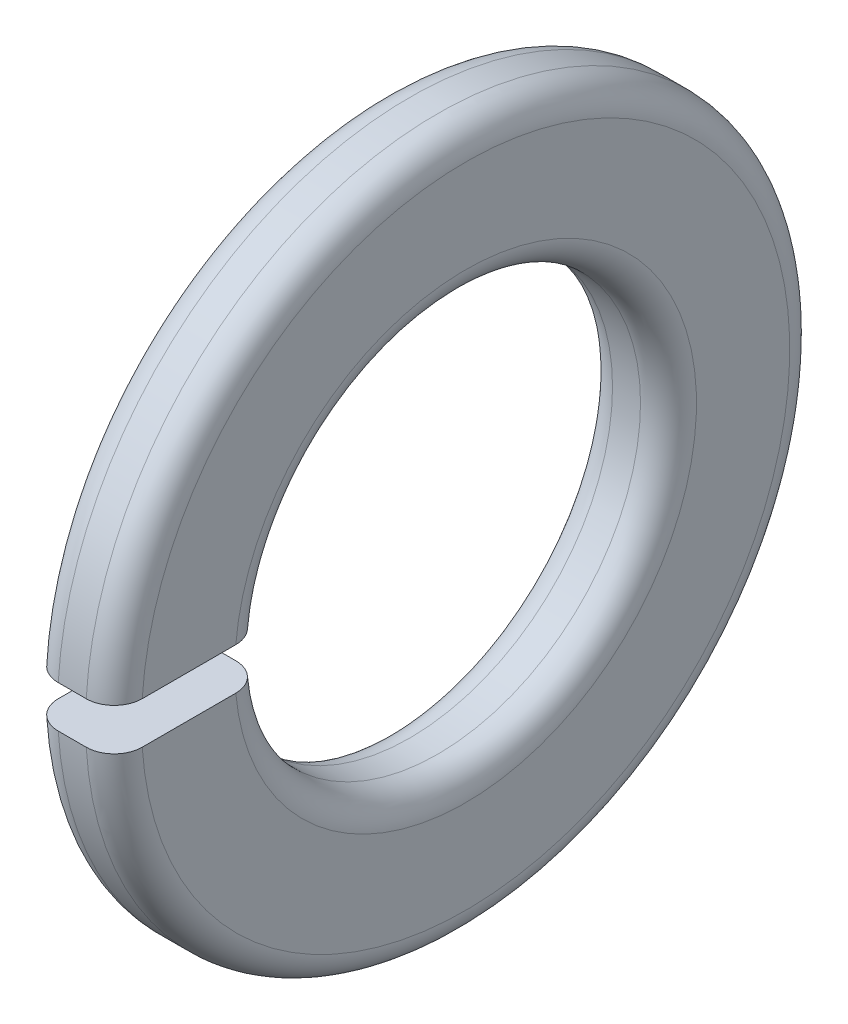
ISO-10303-21;
HEADER;
FILE_DESCRIPTION(('STEP AP214'),'2;1');
FILE_NAME('part.step','',(''),(''),'','','');
FILE_SCHEMA(('AUTOMOTIVE_DESIGN { 1 0 10303 214 1 1 1 1 }'));
ENDSEC;
DATA;
#1=APPLICATION_CONTEXT('core data for automotive mechanical design processes');
#2=APPLICATION_PROTOCOL_DEFINITION('international standard','automotive_design',2000,#1);
#3=PRODUCT_CONTEXT('',#1,'mechanical');
#4=PRODUCT('Part','Part','',(#3));
#5=PRODUCT_RELATED_PRODUCT_CATEGORY('part','',(#4));
#6=PRODUCT_DEFINITION_FORMATION('','',#4);
#7=PRODUCT_DEFINITION_CONTEXT('part definition',#1,'design');
#8=PRODUCT_DEFINITION('design','',#6,#7);
#9=PRODUCT_DEFINITION_SHAPE('','',#8);
#10=(LENGTH_UNIT() NAMED_UNIT(*) SI_UNIT(.MILLI.,.METRE.));
#11=(NAMED_UNIT(*) PLANE_ANGLE_UNIT() SI_UNIT($,.RADIAN.));
#12=(NAMED_UNIT(*) SI_UNIT($,.STERADIAN.) SOLID_ANGLE_UNIT());
#13=UNCERTAINTY_MEASURE_WITH_UNIT(LENGTH_MEASURE(1.E-05),#10,'distance_accuracy_value','');
#14=(GEOMETRIC_REPRESENTATION_CONTEXT(3) GLOBAL_UNCERTAINTY_ASSIGNED_CONTEXT((#13)) GLOBAL_UNIT_ASSIGNED_CONTEXT((#10,
#11,#12)) REPRESENTATION_CONTEXT('',''));
#15=CARTESIAN_POINT('',(0.,0.,0.));
#16=DIRECTION('',(0.,0.,1.));
#17=DIRECTION('',(1.,0.,0.));
#18=AXIS2_PLACEMENT_3D('',#15,#16,#17);
#19=CARTESIAN_POINT('',(-0.599999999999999,0.,0.));
#20=DIRECTION('',(-1.,0.,0.));
#21=DIRECTION('',(0.,0.,1.));
#22=AXIS2_PLACEMENT_3D('',#19,#20,#21);
#23=TOROIDAL_SURFACE('',#22,2.475,0.299999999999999);
#24=CARTESIAN_POINT('',(-0.599999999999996,0.,0.));
#25=DIRECTION('',(-1.,0.,0.));
#26=DIRECTION('',(0.,0.,1.));
#27=AXIS2_PLACEMENT_3D('',#24,#25,#26);
#28=CIRCLE('',#27,2.175);
#29=CARTESIAN_POINT('',(-0.599999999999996,0.225,2.16333076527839));
#30=VERTEX_POINT('',#29);
#31=CARTESIAN_POINT('',(-0.599999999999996,-0.225,2.16333076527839));
#32=VERTEX_POINT('',#31);
#33=EDGE_CURVE('E126',#30,#32,#28,.T.);
#34=ORIENTED_EDGE('',*,*,#33,.F.);
#35=CARTESIAN_POINT('',(-0.65871838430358,0.225,2.16916451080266));
#36=CARTESIAN_POINT('',(-0.675211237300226,0.225,2.17247473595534));
#37=CARTESIAN_POINT('',(-0.691435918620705,0.225,2.17718443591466));
#38=CARTESIAN_POINT('',(-0.722875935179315,0.225,2.18926878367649));
#39=CARTESIAN_POINT('',(-0.738090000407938,0.225,2.1966467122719));
#40=CARTESIAN_POINT('',(-0.767055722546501,0.225,2.21384591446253));
#41=CARTESIAN_POINT('',(-0.780808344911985,0.225,2.22366556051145));
#42=CARTESIAN_POINT('',(-0.806473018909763,0.225,2.24546424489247));
#43=CARTESIAN_POINT('',(-0.818385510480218,0.225,2.25744276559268));
#44=CARTESIAN_POINT('',(-0.840082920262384,0.225,2.28326472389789));
#45=CARTESIAN_POINT('',(-0.849860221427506,0.225,2.29711456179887));
#46=CARTESIAN_POINT('',(-0.866963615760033,0.225,2.32625371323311));
#47=CARTESIAN_POINT('',(-0.874289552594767,0.225,2.34154311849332));
#48=CARTESIAN_POINT('',(-0.886314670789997,0.225,2.37320122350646));
#49=CARTESIAN_POINT('',(-0.891001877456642,0.225,2.3895744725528));
#50=CARTESIAN_POINT('',(-0.897567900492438,0.225,2.42287478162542));
#51=CARTESIAN_POINT('',(-0.899446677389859,0.225,2.43980184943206));
#52=CARTESIAN_POINT('',(-0.900343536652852,0.225,2.47376991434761));
#53=CARTESIAN_POINT('',(-0.899355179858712,0.225,2.49081108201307));
#54=CARTESIAN_POINT('',(-0.894529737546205,0.225,2.52448531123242));
#55=CARTESIAN_POINT('',(-0.890692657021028,0.225,2.54111837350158));
#56=CARTESIAN_POINT('',(-0.880278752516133,0.225,2.57349180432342));
#57=CARTESIAN_POINT('',(-0.873703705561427,0.225,2.5892327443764));
#58=CARTESIAN_POINT('',(-0.85799705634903,0.225,2.61938297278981));
#59=CARTESIAN_POINT('',(-0.848865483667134,0.225,2.63379227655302));
#60=CARTESIAN_POINT('',(-0.828331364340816,0.225,2.66082647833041));
#61=CARTESIAN_POINT('',(-0.81693522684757,0.225,2.67345624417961));
#62=CARTESIAN_POINT('',(-0.792177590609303,0.225,2.69661482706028));
#63=CARTESIAN_POINT('',(-0.778816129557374,0.225,2.70714368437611));
#64=CARTESIAN_POINT('',(-0.750558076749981,0.225,2.72576208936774));
#65=CARTESIAN_POINT('',(-0.735667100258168,0.225,2.73386015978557));
#66=CARTESIAN_POINT('',(-0.704734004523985,0.225,2.7474327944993));
#67=CARTESIAN_POINT('',(-0.688691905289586,0.225,2.75290740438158));
#68=CARTESIAN_POINT('',(-0.655963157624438,0.225,2.761062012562));
#69=CARTESIAN_POINT('',(-0.639278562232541,0.225,2.7637502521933));
#70=CARTESIAN_POINT('',(-0.605694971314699,0.225,2.76628295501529));
#71=CARTESIAN_POINT('',(-0.58879597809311,0.225,2.76612744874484));
#72=CARTESIAN_POINT('',(-0.555289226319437,0.225,2.76297952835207));
#73=CARTESIAN_POINT('',(-0.538681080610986,0.225,2.75999123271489));
#74=CARTESIAN_POINT('',(-0.506201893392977,0.225,2.7512700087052));
#75=CARTESIAN_POINT('',(-0.490330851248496,0.225,2.74553708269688));
#76=CARTESIAN_POINT('',(-0.45976749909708,0.225,2.73148837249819));
#77=CARTESIAN_POINT('',(-0.445075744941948,0.225,2.72317137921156));
#78=CARTESIAN_POINT('',(-0.417292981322,0.225,2.70419414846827));
#79=CARTESIAN_POINT('',(-0.404201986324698,0.225,2.69353388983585));
#80=CARTESIAN_POINT('',(-0.379959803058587,0.225,2.67014807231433));
#81=CARTESIAN_POINT('',(-0.36881305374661,0.225,2.65741791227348));
#82=CARTESIAN_POINT('',(-0.348806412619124,0.225,2.63027228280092));
#83=CARTESIAN_POINT('',(-0.339946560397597,0.225,2.61585678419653));
#84=CARTESIAN_POINT('',(-0.324733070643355,0.225,2.58569775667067));
#85=CARTESIAN_POINT('',(-0.318388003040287,0.225,2.56994990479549));
#86=CARTESIAN_POINT('',(-0.308421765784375,0.225,2.53761469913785));
#87=CARTESIAN_POINT('',(-0.304800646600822,0.225,2.52102732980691));
#88=CARTESIAN_POINT('',(-0.300373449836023,0.225,2.48742411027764));
#89=CARTESIAN_POINT('',(-0.299576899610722,0.225,2.47040700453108));
#90=CARTESIAN_POINT('',(-0.300845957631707,0.225,2.43647972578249));
#91=CARTESIAN_POINT('',(-0.302911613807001,0.225,2.4195695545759));
#92=CARTESIAN_POINT('',(-0.309853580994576,0.225,2.38630164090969));
#93=CARTESIAN_POINT('',(-0.314735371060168,0.225,2.36994504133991));
#94=CARTESIAN_POINT('',(-0.3271773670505,0.225,2.33828415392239));
#95=CARTESIAN_POINT('',(-0.334737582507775,0.225,2.32297986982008));
#96=CARTESIAN_POINT('',(-0.35231952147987,0.225,2.29387051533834));
#97=CARTESIAN_POINT('',(-0.362339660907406,0.225,2.28006448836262));
#98=CARTESIAN_POINT('',(-0.384562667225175,0.225,2.25433854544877));
#99=CARTESIAN_POINT('',(-0.396765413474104,0.225,2.24241852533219));
#100=CARTESIAN_POINT('',(-0.422961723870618,0.225,2.22084962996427));
#101=CARTESIAN_POINT('',(-0.43694868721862,0.225,2.21119273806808));
#102=CARTESIAN_POINT('',(-0.466355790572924,0.225,2.19437549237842));
#103=CARTESIAN_POINT('',(-0.481776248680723,0.225,2.18721569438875));
#104=CARTESIAN_POINT('',(-0.513533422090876,0.225,2.17563318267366));
#105=CARTESIAN_POINT('',(-0.529865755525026,0.225,2.17119843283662));
#106=CARTESIAN_POINT('',(-0.563030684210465,0.225,2.16515166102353));
#107=CARTESIAN_POINT('',(-0.579862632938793,0.225,2.16353614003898));
#108=CARTESIAN_POINT('',(-0.607101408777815,0.225,2.16323341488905));
#109=CARTESIAN_POINT('',(-0.617506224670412,0.225,2.16366327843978));
#110=CARTESIAN_POINT('',(-0.638214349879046,0.225,2.16560515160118));
#111=CARTESIAN_POINT('',(-0.648517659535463,0.225,2.16711715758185));
#112=CARTESIAN_POINT('',(-0.65871838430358,0.225,2.16916451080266));
#113=B_SPLINE_CURVE_WITH_KNOTS('',3,(#35,#36,#37,#38,#39,#40,#41,#42,#43,#44,#45,#46,#47,#48,
#49,#50,#51,#52,#53,#54,#55,#56,#57,#58,#59,#60,#61,#62,#63,#64,#65,#66,#67,#68,#69,#70,#71,#72,
#73,#74,#75,#76,#77,#78,#79,#80,#81,#82,#83,#84,#85,#86,#87,#88,#89,#90,#91,#92,#93,#94,#95,#96,
#97,#98,#99,#100,#101,#102,#103,#104,#105,#106,#107,#108,#109,#110,#111,#112),.UNSPECIFIED.,.T.,
.F.,(4,2,2,2,2,2,2,2,2,2,2,2,2,2,2,2,2,2,2,2,2,2,2,2,2,2,2,2,2,2,2,2,2,2,2,2,2,2,4),(0.,
0.0504271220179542,0.100916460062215,0.151372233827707,0.201815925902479,0.252436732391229,
0.303060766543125,0.353912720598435,0.404765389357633,0.455732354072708,0.506699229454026,
0.557633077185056,0.608566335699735,0.659357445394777,0.710147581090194,0.760757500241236,
0.811366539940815,0.861825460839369,0.912283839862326,0.962668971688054,1.01305406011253,
1.06346275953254,1.11387191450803,1.16439469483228,1.21491834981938,1.26561272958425,
1.31630804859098,1.36717420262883,1.41804120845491,1.46900751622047,1.51997400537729,
1.57090775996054,1.62183870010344,1.67258640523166,1.72334539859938,1.77387855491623,
1.82434894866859,1.85553790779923,1.88672676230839),.UNSPECIFIED.);
#114=CARTESIAN_POINT('',(-0.9,0.225,2.46475150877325));
#115=VERTEX_POINT('',#114);
#116=EDGE_CURVE('E50',#30,#115,#113,.T.);
#117=ORIENTED_EDGE('',*,*,#116,.T.);
#118=CARTESIAN_POINT('',(-0.899999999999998,0.,0.));
#119=DIRECTION('',(-1.,0.,0.));
#120=DIRECTION('',(0.,0.,1.));
#121=AXIS2_PLACEMENT_3D('',#118,#119,#120);
#122=CIRCLE('',#121,2.475);
#123=CARTESIAN_POINT('',(-0.9,-0.225,2.46475150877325));
#124=VERTEX_POINT('',#123);
#125=EDGE_CURVE('E138',#115,#124,#122,.T.);
#126=ORIENTED_EDGE('',*,*,#125,.T.);
#127=CARTESIAN_POINT('',(-0.65871838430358,-0.225,2.16916451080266));
#128=CARTESIAN_POINT('',(-0.642276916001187,-0.225,2.16586614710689));
#129=CARTESIAN_POINT('',(-0.625545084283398,-0.225,2.16395367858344));
#130=CARTESIAN_POINT('',(-0.591984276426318,-0.225,2.16296535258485));
#131=CARTESIAN_POINT('',(-0.57515520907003,-0.225,2.16389283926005));
#132=CARTESIAN_POINT('',(-0.541899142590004,-0.225,2.16856069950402));
#133=CARTESIAN_POINT('',(-0.525471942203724,-0.225,2.17229963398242));
#134=CARTESIAN_POINT('',(-0.493481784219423,-0.225,2.18247834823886));
#135=CARTESIAN_POINT('',(-0.47791862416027,-0.225,2.18891749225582));
#136=CARTESIAN_POINT('',(-0.448070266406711,-0.225,2.20431882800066));
#137=CARTESIAN_POINT('',(-0.433786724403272,-0.225,2.2132842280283));
#138=CARTESIAN_POINT('',(-0.406918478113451,-0.225,2.23347629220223));
#139=CARTESIAN_POINT('',(-0.394333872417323,-0.225,2.24470308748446));
#140=CARTESIAN_POINT('',(-0.371162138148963,-0.225,2.26915061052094));
#141=CARTESIAN_POINT('',(-0.360583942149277,-0.225,2.28237980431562));
#142=CARTESIAN_POINT('',(-0.341786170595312,-0.225,2.31041933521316));
#143=CARTESIAN_POINT('',(-0.333566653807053,-0.225,2.32522971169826));
#144=CARTESIAN_POINT('',(-0.319679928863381,-0.225,2.35608684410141));
#145=CARTESIAN_POINT('',(-0.314024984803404,-0.225,2.37213911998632));
#146=CARTESIAN_POINT('',(-0.305481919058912,-0.225,2.40496381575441));
#147=CARTESIAN_POINT('',(-0.302593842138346,-0.225,2.42173624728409));
#148=CARTESIAN_POINT('',(-0.299661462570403,-0.225,2.45557450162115));
#149=CARTESIAN_POINT('',(-0.299624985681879,-0.225,2.4726410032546));
#150=CARTESIAN_POINT('',(-0.302418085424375,-0.225,2.50653800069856));
#151=CARTESIAN_POINT('',(-0.30524767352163,-0.225,2.52336849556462));
#152=CARTESIAN_POINT('',(-0.313694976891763,-0.225,2.55631201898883));
#153=CARTESIAN_POINT('',(-0.319312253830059,-0.225,2.57242515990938));
#154=CARTESIAN_POINT('',(-0.333178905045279,-0.225,2.60347615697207));
#155=CARTESIAN_POINT('',(-0.341428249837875,-0.225,2.61841402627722));
#156=CARTESIAN_POINT('',(-0.360303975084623,-0.225,2.64664964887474));
#157=CARTESIAN_POINT('',(-0.370924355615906,-0.225,2.65995141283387));
#158=CARTESIAN_POINT('',(-0.394254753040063,-0.225,2.68457520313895));
#159=CARTESIAN_POINT('',(-0.40696473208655,-0.225,2.69589726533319));
#160=CARTESIAN_POINT('',(-0.43406557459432,-0.225,2.71619786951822));
#161=CARTESIAN_POINT('',(-0.448450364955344,-0.225,2.72518451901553));
#162=CARTESIAN_POINT('',(-0.478528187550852,-0.225,2.74060635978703));
#163=CARTESIAN_POINT('',(-0.494221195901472,-0.225,2.74704159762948));
#164=CARTESIAN_POINT('',(-0.526416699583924,-0.225,2.7571577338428));
#165=CARTESIAN_POINT('',(-0.542916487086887,-0.225,2.76084725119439));
#166=CARTESIAN_POINT('',(-0.57630151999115,-0.225,2.76539838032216));
#167=CARTESIAN_POINT('',(-0.593186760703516,-0.225,2.76626002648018));
#168=CARTESIAN_POINT('',(-0.626831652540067,-0.225,2.7651315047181));
#169=CARTESIAN_POINT('',(-0.643591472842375,-0.225,2.76314637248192));
#170=CARTESIAN_POINT('',(-0.676539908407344,-0.225,2.75639078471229));
#171=CARTESIAN_POINT('',(-0.692728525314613,-0.225,2.751620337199));
#172=CARTESIAN_POINT('',(-0.724077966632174,-0.225,2.73943093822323));
#173=CARTESIAN_POINT('',(-0.73923866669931,-0.225,2.73201166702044));
#174=CARTESIAN_POINT('',(-0.768102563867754,-0.225,2.71473793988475));
#175=CARTESIAN_POINT('',(-0.781805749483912,-0.225,2.70488346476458));
#176=CARTESIAN_POINT('',(-0.807395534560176,-0.225,2.68299951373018));
#177=CARTESIAN_POINT('',(-0.819278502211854,-0.225,2.67096579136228));
#178=CARTESIAN_POINT('',(-0.840863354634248,-0.225,2.64507984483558));
#179=CARTESIAN_POINT('',(-0.850565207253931,-0.225,2.63122759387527));
#180=CARTESIAN_POINT('',(-0.867546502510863,-0.225,2.60204995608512));
#181=CARTESIAN_POINT('',(-0.874817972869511,-0.225,2.58671992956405));
#182=CARTESIAN_POINT('',(-0.886694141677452,-0.225,2.55505955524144));
#183=CARTESIAN_POINT('',(-0.891298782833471,-0.225,2.5387291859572));
#184=CARTESIAN_POINT('',(-0.897726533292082,-0.225,2.50547104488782));
#185=CARTESIAN_POINT('',(-0.899539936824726,-0.225,2.48854139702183));
#186=CARTESIAN_POINT('',(-0.900305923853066,-0.225,2.45461740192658));
#187=CARTESIAN_POINT('',(-0.899258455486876,-0.225,2.43762305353));
#188=CARTESIAN_POINT('',(-0.894327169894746,-0.225,2.40401036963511));
#189=CARTESIAN_POINT('',(-0.890436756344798,-0.225,2.38739300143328));
#190=CARTESIAN_POINT('',(-0.879921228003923,-0.225,2.35504780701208));
#191=CARTESIAN_POINT('',(-0.873296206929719,-0.225,2.33931995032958));
#192=CARTESIAN_POINT('',(-0.85749849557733,-0.225,2.309205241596));
#193=CARTESIAN_POINT('',(-0.848326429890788,-0.225,2.294818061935));
#194=CARTESIAN_POINT('',(-0.827687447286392,-0.225,2.26778997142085));
#195=CARTESIAN_POINT('',(-0.816219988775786,-0.225,2.25514947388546));
#196=CARTESIAN_POINT('',(-0.791348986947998,-0.225,2.23201600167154));
#197=CARTESIAN_POINT('',(-0.77795047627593,-0.225,2.22151761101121));
#198=CARTESIAN_POINT('',(-0.749583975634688,-0.225,2.20294330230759));
#199=CARTESIAN_POINT('',(-0.734617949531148,-0.225,2.19486440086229));
#200=CARTESIAN_POINT('',(-0.709396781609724,-0.225,2.18389737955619));
#201=CARTESIAN_POINT('',(-0.69948543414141,-0.225,2.18019958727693));
#202=CARTESIAN_POINT('',(-0.67932729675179,-0.225,2.17387253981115));
#203=CARTESIAN_POINT('',(-0.669080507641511,-0.225,2.17124328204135));
#204=CARTESIAN_POINT('',(-0.65871838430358,-0.225,2.16916451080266));
#205=B_SPLINE_CURVE_WITH_KNOTS('',3,(#127,#128,#129,#130,#131,#132,#133,#134,#135,#136,#137,
#138,#139,#140,#141,#142,#143,#144,#145,#146,#147,#148,#149,#150,#151,#152,#153,#154,#155,#156,
#157,#158,#159,#160,#161,#162,#163,#164,#165,#166,#167,#168,#169,#170,#171,#172,#173,#174,#175,
#176,#177,#178,#179,#180,#181,#182,#183,#184,#185,#186,#187,#188,#189,#190,#191,#192,#193,#194,
#195,#196,#197,#198,#199,#200,#201,#202,#203,#204),.UNSPECIFIED.,.T.,.F.,(4,2,2,2,2,2,2,2,2,2,2,
2,2,2,2,2,2,2,2,2,2,2,2,2,2,2,2,2,2,2,2,2,2,2,2,2,2,2,4),(0.,0.0502685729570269,
0.100596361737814,0.150898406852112,0.201188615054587,0.251542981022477,0.301900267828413,
0.352476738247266,0.403054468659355,0.453871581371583,0.504689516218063,0.555646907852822,
0.606604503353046,0.657554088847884,0.708503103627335,0.75932462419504,0.810145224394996,
0.860786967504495,0.911427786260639,0.961908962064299,1.01238952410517,1.06278090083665,
1.11317213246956,1.16356944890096,1.21396716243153,1.26446415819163,1.314961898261,
1.36562369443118,1.41628657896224,1.46712523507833,1.5179648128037,1.56892272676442,
1.61987889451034,1.67082257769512,1.72177829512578,1.7726035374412,1.82336584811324,
1.85504735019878,1.88672877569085),.UNSPECIFIED.);
#206=EDGE_CURVE('E117',#124,#32,#205,.T.);
#207=ORIENTED_EDGE('',*,*,#206,.T.);
#208=EDGE_LOOP('',(#34,#117,#126,#207));
#209=FACE_BOUND('',#208,.T.);
#210=ADVANCED_FACE('F36',(#209),#23,.T.);
#211=CARTESIAN_POINT('',(-0.9,3.475,0.));
#212=DIRECTION('',(1.,0.,0.));
#213=DIRECTION('',(0.,0.,-1.));
#214=AXIS2_PLACEMENT_3D('',#211,#212,#213);
#215=PLANE('',#214);
#216=DIRECTION('',(0.,0.,-1.));
#217=VECTOR('',#216,1.);
#218=CARTESIAN_POINT('',(-0.9,0.225,3.8505));
#219=LINE('',#218,#217);
#220=CARTESIAN_POINT('',(-0.9,0.225,3.46770817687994));
#221=VERTEX_POINT('',#220);
#222=EDGE_CURVE('E106',#221,#115,#219,.T.);
#223=ORIENTED_EDGE('',*,*,#222,.F.);
#224=CARTESIAN_POINT('',(-0.899999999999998,0.,0.));
#225=DIRECTION('',(-1.,0.,0.));
#226=DIRECTION('',(0.,0.,1.));
#227=AXIS2_PLACEMENT_3D('',#224,#225,#226);
#228=CIRCLE('',#227,3.475);
#229=CARTESIAN_POINT('',(-0.9,-0.225,3.46770817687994));
#230=VERTEX_POINT('',#229);
#231=EDGE_CURVE('E135',#221,#230,#228,.T.);
#232=ORIENTED_EDGE('',*,*,#231,.T.);
#233=DIRECTION('',(0.,0.,1.));
#234=VECTOR('',#233,1.);
#235=CARTESIAN_POINT('',(-0.9,-0.225,0.));
#236=LINE('',#235,#234);
#237=EDGE_CURVE('E118',#124,#230,#236,.T.);
#238=ORIENTED_EDGE('',*,*,#237,.F.);
#239=ORIENTED_EDGE('',*,*,#125,.F.);
#240=EDGE_LOOP('',(#223,#232,#238,#239));
#241=FACE_BOUND('',#240,.T.);
#242=ADVANCED_FACE('F211',(#241),#215,.F.);
#243=CARTESIAN_POINT('',(-0.6,0.,0.));
#244=DIRECTION('',(-1.,0.,0.));
#245=DIRECTION('',(0.,0.,1.));
#246=AXIS2_PLACEMENT_3D('',#243,#244,#245);
#247=TOROIDAL_SURFACE('',#246,3.475,0.3);
#248=CARTESIAN_POINT('',(-0.740885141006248,0.225,3.20224406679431));
#249=CARTESIAN_POINT('',(-0.726044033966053,0.225,3.19433115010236));
#250=CARTESIAN_POINT('',(-0.710524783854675,0.225,3.18766439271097));
#251=CARTESIAN_POINT('',(-0.678574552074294,0.225,3.17702533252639));
#252=CARTESIAN_POINT('',(-0.662142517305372,0.225,3.17305621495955));
#253=CARTESIAN_POINT('',(-0.628850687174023,0.225,3.16793624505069));
#254=CARTESIAN_POINT('',(-0.611991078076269,0.225,3.16678418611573));
#255=CARTESIAN_POINT('',(-0.578322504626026,0.225,3.16732925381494));
#256=CARTESIAN_POINT('',(-0.561513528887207,0.225,3.16902568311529));
#257=CARTESIAN_POINT('',(-0.528426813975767,0.225,3.17521562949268));
#258=CARTESIAN_POINT('',(-0.512148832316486,0.225,3.1797078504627));
#259=CARTESIAN_POINT('',(-0.480576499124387,0.225,3.19135918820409));
#260=CARTESIAN_POINT('',(-0.465282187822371,0.225,3.19851841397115));
#261=CARTESIAN_POINT('',(-0.436096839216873,0.225,3.21530576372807));
#262=CARTESIAN_POINT('',(-0.422207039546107,0.225,3.22493603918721));
#263=CARTESIAN_POINT('',(-0.396236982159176,0.225,3.24638716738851));
#264=CARTESIAN_POINT('',(-0.384156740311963,0.225,3.25820803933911));
#265=CARTESIAN_POINT('',(-0.362120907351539,0.225,3.28373154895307));
#266=CARTESIAN_POINT('',(-0.352169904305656,0.225,3.29743814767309));
#267=CARTESIAN_POINT('',(-0.334704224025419,0.225,3.32632438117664));
#268=CARTESIAN_POINT('',(-0.327189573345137,0.225,3.34150403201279));
#269=CARTESIAN_POINT('',(-0.31479292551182,0.225,3.37294200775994));
#270=CARTESIAN_POINT('',(-0.309916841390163,0.225,3.3892026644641));
#271=CARTESIAN_POINT('',(-0.302959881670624,0.225,3.42231137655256));
#272=CARTESIAN_POINT('',(-0.30087903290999,0.225,3.43915943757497));
#273=CARTESIAN_POINT('',(-0.299570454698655,0.225,3.47298759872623));
#274=CARTESIAN_POINT('',(-0.300346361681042,0.225,3.48996783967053));
#275=CARTESIAN_POINT('',(-0.304738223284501,0.225,3.52355704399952));
#276=CARTESIAN_POINT('',(-0.3083541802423,0.225,3.54016600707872));
#277=CARTESIAN_POINT('',(-0.31832437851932,0.225,3.57253831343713));
#278=CARTESIAN_POINT('',(-0.324678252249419,0.225,3.58830176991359));
#279=CARTESIAN_POINT('',(-0.339945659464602,0.225,3.61853622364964));
#280=CARTESIAN_POINT('',(-0.348859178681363,0.225,3.63300722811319));
#281=CARTESIAN_POINT('',(-0.368980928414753,0.225,3.66022522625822));
#282=CARTESIAN_POINT('',(-0.380186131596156,0.225,3.67297445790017));
#283=CARTESIAN_POINT('',(-0.404581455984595,0.225,3.69640647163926));
#284=CARTESIAN_POINT('',(-0.417771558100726,0.225,3.70708927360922));
#285=CARTESIAN_POINT('',(-0.445736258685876,0.225,3.72606430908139));
#286=CARTESIAN_POINT('',(-0.460507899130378,0.225,3.73436090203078));
#287=CARTESIAN_POINT('',(-0.49123607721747,0.225,3.74835170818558));
#288=CARTESIAN_POINT('',(-0.507192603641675,0.225,3.75404594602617));
#289=CARTESIAN_POINT('',(-0.539809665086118,0.225,3.76266133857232));
#290=CARTESIAN_POINT('',(-0.556469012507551,0.225,3.76558698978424));
#291=CARTESIAN_POINT('',(-0.590042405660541,0.225,3.76859728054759));
#292=CARTESIAN_POINT('',(-0.606956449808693,0.225,3.76868193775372));
#293=CARTESIAN_POINT('',(-0.640544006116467,0.225,3.76600898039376));
#294=CARTESIAN_POINT('',(-0.657217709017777,0.225,3.76325376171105));
#295=CARTESIAN_POINT('',(-0.689866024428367,0.225,3.75498370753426));
#296=CARTESIAN_POINT('',(-0.705840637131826,0.225,3.74946887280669));
#297=CARTESIAN_POINT('',(-0.736641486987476,0.225,3.73583593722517));
#298=CARTESIAN_POINT('',(-0.751467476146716,0.225,3.72771727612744));
#299=CARTESIAN_POINT('',(-0.779548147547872,0.225,3.70910895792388));
#300=CARTESIAN_POINT('',(-0.792802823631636,0.225,3.69861929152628));
#301=CARTESIAN_POINT('',(-0.817382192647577,0.225,3.67555380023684));
#302=CARTESIAN_POINT('',(-0.828704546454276,0.225,3.66297548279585));
#303=CARTESIAN_POINT('',(-0.84908136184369,0.225,3.63609941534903));
#304=CARTESIAN_POINT('',(-0.858135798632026,0.225,3.62180164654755));
#305=CARTESIAN_POINT('',(-0.873737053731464,0.225,3.59186528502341));
#306=CARTESIAN_POINT('',(-0.880279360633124,0.225,3.5762243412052));
#307=CARTESIAN_POINT('',(-0.890650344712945,0.225,3.54406725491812));
#308=CARTESIAN_POINT('',(-0.894478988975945,0.225,3.52755110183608));
#309=CARTESIAN_POINT('',(-0.899320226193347,0.225,3.49408169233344));
#310=CARTESIAN_POINT('',(-0.90032790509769,0.225,3.47712772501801));
#311=CARTESIAN_POINT('',(-0.899485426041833,0.225,3.44329153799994));
#312=CARTESIAN_POINT('',(-0.897635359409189,0.225,3.42640931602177));
#313=CARTESIAN_POINT('',(-0.891127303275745,0.225,3.39318078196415));
#314=CARTESIAN_POINT('',(-0.886467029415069,0.225,3.37683491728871));
#315=CARTESIAN_POINT('',(-0.874465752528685,0.225,3.34515365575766));
#316=CARTESIAN_POINT('',(-0.867124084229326,0.225,3.32981851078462));
#317=CARTESIAN_POINT('',(-0.849968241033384,0.225,3.30060051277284));
#318=CARTESIAN_POINT('',(-0.840153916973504,0.225,3.28671774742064));
#319=CARTESIAN_POINT('',(-0.818336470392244,0.225,3.26081393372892));
#320=CARTESIAN_POINT('',(-0.806336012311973,0.225,3.24879065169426));
#321=CARTESIAN_POINT('',(-0.78532389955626,0.225,3.23102383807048));
#322=CARTESIAN_POINT('',(-0.776868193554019,0.225,3.22461127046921));
#323=CARTESIAN_POINT('',(-0.759326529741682,0.225,3.2127154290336));
#324=CARTESIAN_POINT('',(-0.750240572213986,0.225,3.20723215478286));
#325=CARTESIAN_POINT('',(-0.740885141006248,0.225,3.20224406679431));
#326=B_SPLINE_CURVE_WITH_KNOTS('',3,(#248,#249,#250,#251,#252,#253,#254,#255,#256,#257,#258,
#259,#260,#261,#262,#263,#264,#265,#266,#267,#268,#269,#270,#271,#272,#273,#274,#275,#276,#277,
#278,#279,#280,#281,#282,#283,#284,#285,#286,#287,#288,#289,#290,#291,#292,#293,#294,#295,#296,
#297,#298,#299,#300,#301,#302,#303,#304,#305,#306,#307,#308,#309,#310,#311,#312,#313,#314,#315,
#316,#317,#318,#319,#320,#321,#322,#323,#324,#325),.UNSPECIFIED.,.T.,.F.,(4,2,2,2,2,2,2,2,2,2,2,
2,2,2,2,2,2,2,2,2,2,2,2,2,2,2,2,2,2,2,2,2,2,2,2,2,2,2,4),(0.,0.0504178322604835,
0.100895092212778,0.151350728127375,0.201794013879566,0.252213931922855,0.302635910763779,
0.353101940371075,0.403568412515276,0.454142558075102,0.504717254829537,0.555404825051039,
0.606092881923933,0.656845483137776,0.707598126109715,0.758343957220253,0.80908950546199,
0.859768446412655,0.910446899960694,0.961032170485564,1.01161696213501,1.06211945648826,
1.11262163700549,1.16308124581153,1.21354084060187,1.26401129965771,1.31448195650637,
1.36501328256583,1.41554516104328,1.4661673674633,1.51679018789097,1.56750113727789,
1.61821046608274,1.66896107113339,1.71972427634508,1.77049054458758,1.82119534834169,
1.85297739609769,1.88475942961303),.UNSPECIFIED.);
#327=CARTESIAN_POINT('',(-0.599999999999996,0.225,3.76828873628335));
#328=VERTEX_POINT('',#327);
#329=EDGE_CURVE('E149',#328,#221,#326,.T.);
#330=ORIENTED_EDGE('',*,*,#329,.F.);
#331=CARTESIAN_POINT('',(-0.599999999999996,0.,0.));
#332=DIRECTION('',(-1.,0.,0.));
#333=DIRECTION('',(0.,0.,1.));
#334=AXIS2_PLACEMENT_3D('',#331,#332,#333);
#335=CIRCLE('',#334,3.775);
#336=CARTESIAN_POINT('',(-0.599999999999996,-0.225,3.76828873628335));
#337=VERTEX_POINT('',#336);
#338=EDGE_CURVE('E132',#328,#337,#335,.T.);
#339=ORIENTED_EDGE('',*,*,#338,.T.);
#340=CARTESIAN_POINT('',(-0.740885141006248,-0.225,3.20224406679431));
#341=CARTESIAN_POINT('',(-0.755769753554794,-0.225,3.21018188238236));
#342=CARTESIAN_POINT('',(-0.769993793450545,-0.225,3.21938485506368));
#343=CARTESIAN_POINT('',(-0.79670537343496,-0.225,3.24005758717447));
#344=CARTESIAN_POINT('',(-0.809190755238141,-0.225,3.25153012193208));
#345=CARTESIAN_POINT('',(-0.832052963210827,-0.225,3.27640206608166));
#346=CARTESIAN_POINT('',(-0.842431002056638,-0.225,3.28980035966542));
#347=CARTESIAN_POINT('',(-0.860791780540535,-0.225,3.3181429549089));
#348=CARTESIAN_POINT('',(-0.868775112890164,-0.225,3.33308687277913));
#349=CARTESIAN_POINT('',(-0.882138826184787,-0.225,3.36412761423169));
#350=CARTESIAN_POINT('',(-0.887514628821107,-0.225,3.38022640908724));
#351=CARTESIAN_POINT('',(-0.895491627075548,-0.225,3.4130980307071));
#352=CARTESIAN_POINT('',(-0.898092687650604,-0.225,3.42987089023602));
#353=CARTESIAN_POINT('',(-0.900448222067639,-0.225,3.46363857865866));
#354=CARTESIAN_POINT('',(-0.900198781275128,-0.225,3.4806336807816));
#355=CARTESIAN_POINT('',(-0.896850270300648,-0.225,3.51434083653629));
#356=CARTESIAN_POINT('',(-0.893751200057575,-0.225,3.53105289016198));
#357=CARTESIAN_POINT('',(-0.884789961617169,-0.225,3.56371905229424));
#358=CARTESIAN_POINT('',(-0.878927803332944,-0.225,3.57967316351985));
#359=CARTESIAN_POINT('',(-0.864605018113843,-0.225,3.61036897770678));
#360=CARTESIAN_POINT('',(-0.856144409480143,-0.225,3.62511068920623));
#361=CARTESIAN_POINT('',(-0.836875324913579,-0.225,3.65294343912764));
#362=CARTESIAN_POINT('',(-0.826069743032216,-0.225,3.666036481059));
#363=CARTESIAN_POINT('',(-0.802410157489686,-0.225,3.69021849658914));
#364=CARTESIAN_POINT('',(-0.789556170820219,-0.225,3.70130748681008));
#365=CARTESIAN_POINT('',(-0.762189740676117,-0.225,3.72114505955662));
#366=CARTESIAN_POINT('',(-0.747680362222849,-0.225,3.72989787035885));
#367=CARTESIAN_POINT('',(-0.717396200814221,-0.225,3.74483858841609));
#368=CARTESIAN_POINT('',(-0.701621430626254,-0.225,3.75102652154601));
#369=CARTESIAN_POINT('',(-0.669282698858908,-0.225,3.76065154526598));
#370=CARTESIAN_POINT('',(-0.652720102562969,-0.225,3.76409322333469));
#371=CARTESIAN_POINT('',(-0.619252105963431,-0.225,3.76814422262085));
#372=CARTESIAN_POINT('',(-0.602346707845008,-0.225,3.76875356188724));
#373=CARTESIAN_POINT('',(-0.56868972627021,-0.225,3.7671231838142));
#374=CARTESIAN_POINT('',(-0.551938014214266,-0.225,3.76488611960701));
#375=CARTESIAN_POINT('',(-0.519047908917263,-0.225,3.75763164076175));
#376=CARTESIAN_POINT('',(-0.502909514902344,-0.225,3.75261422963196));
#377=CARTESIAN_POINT('',(-0.471701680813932,-0.225,3.73994197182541));
#378=CARTESIAN_POINT('',(-0.456632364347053,-0.225,3.73228682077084));
#379=CARTESIAN_POINT('',(-0.427990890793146,-0.225,3.71455795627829));
#380=CARTESIAN_POINT('',(-0.414418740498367,-0.225,3.70448423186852));
#381=CARTESIAN_POINT('',(-0.389140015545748,-0.225,3.68219268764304));
#382=CARTESIAN_POINT('',(-0.377435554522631,-0.225,3.66997247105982));
#383=CARTESIAN_POINT('',(-0.356240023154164,-0.225,3.64374348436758));
#384=CARTESIAN_POINT('',(-0.346748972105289,-0.225,3.62973469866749));
#385=CARTESIAN_POINT('',(-0.330231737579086,-0.225,3.60029996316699));
#386=CARTESIAN_POINT('',(-0.323209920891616,-0.225,3.58487156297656));
#387=CARTESIAN_POINT('',(-0.311850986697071,-0.225,3.55305625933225));
#388=CARTESIAN_POINT('',(-0.307513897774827,-0.225,3.53666934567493));
#389=CARTESIAN_POINT('',(-0.301640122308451,-0.225,3.50337128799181));
#390=CARTESIAN_POINT('',(-0.300108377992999,-0.225,3.48645927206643));
#391=CARTESIAN_POINT('',(-0.299902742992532,-0.225,3.45261784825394));
#392=CARTESIAN_POINT('',(-0.301228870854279,-0.225,3.43568844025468));
#393=CARTESIAN_POINT('',(-0.306704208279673,-0.225,3.40227463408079));
#394=CARTESIAN_POINT('',(-0.310856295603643,-0.225,3.38579070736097));
#395=CARTESIAN_POINT('',(-0.321869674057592,-0.225,3.3537540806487));
#396=CARTESIAN_POINT('',(-0.32873097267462,-0.225,3.33820138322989));
#397=CARTESIAN_POINT('',(-0.344967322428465,-0.225,3.30847434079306));
#398=CARTESIAN_POINT('',(-0.354341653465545,-0.225,3.29429960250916));
#399=CARTESIAN_POINT('',(-0.375340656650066,-0.225,3.26772838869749));
#400=CARTESIAN_POINT('',(-0.386965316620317,-0.225,3.2553319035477));
#401=CARTESIAN_POINT('',(-0.412115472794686,-0.225,3.23269141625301));
#402=CARTESIAN_POINT('',(-0.42563785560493,-0.225,3.22244395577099));
#403=CARTESIAN_POINT('',(-0.454213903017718,-0.225,3.20437139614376));
#404=CARTESIAN_POINT('',(-0.469267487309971,-0.225,3.19654617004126));
#405=CARTESIAN_POINT('',(-0.500439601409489,-0.225,3.18355949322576));
#406=CARTESIAN_POINT('',(-0.516555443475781,-0.225,3.17839159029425));
#407=CARTESIAN_POINT('',(-0.549431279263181,-0.225,3.17083933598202));
#408=CARTESIAN_POINT('',(-0.56619142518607,-0.225,3.16845564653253));
#409=CARTESIAN_POINT('',(-0.599848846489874,-0.225,3.16654364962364));
#410=CARTESIAN_POINT('',(-0.61674590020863,-0.225,3.16701139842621));
#411=CARTESIAN_POINT('',(-0.650206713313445,-0.225,3.17078033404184));
#412=CARTESIAN_POINT('',(-0.666770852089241,-0.225,3.17407808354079));
#413=CARTESIAN_POINT('',(-0.692966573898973,-0.225,3.18163061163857));
#414=CARTESIAN_POINT('',(-0.702847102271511,-0.225,3.18504947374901));
#415=CARTESIAN_POINT('',(-0.722197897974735,-0.225,3.19289854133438));
#416=CARTESIAN_POINT('',(-0.731668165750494,-0.225,3.19732874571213));
#417=CARTESIAN_POINT('',(-0.740885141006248,-0.225,3.20224406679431));
#418=B_SPLINE_CURVE_WITH_KNOTS('',3,(#340,#341,#342,#343,#344,#345,#346,#347,#348,#349,#350,
#351,#352,#353,#354,#355,#356,#357,#358,#359,#360,#361,#362,#363,#364,#365,#366,#367,#368,#369,
#370,#371,#372,#373,#374,#375,#376,#377,#378,#379,#380,#381,#382,#383,#384,#385,#386,#387,#388,
#389,#390,#391,#392,#393,#394,#395,#396,#397,#398,#399,#400,#401,#402,#403,#404,#405,#406,#407,
#408,#409,#410,#411,#412,#413,#414,#415,#416,#417),.UNSPECIFIED.,.T.,.F.,(4,2,2,2,2,2,2,2,2,2,2,
2,2,2,2,2,2,2,2,2,2,2,2,2,2,2,2,2,2,2,2,2,2,2,2,2,2,2,4),(0.,0.0505685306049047,
0.101199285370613,0.151800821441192,0.202389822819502,0.253067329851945,0.30374730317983,
0.354496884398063,0.405246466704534,0.455995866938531,0.506744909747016,0.557431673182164,
0.608118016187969,0.65871198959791,0.709305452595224,0.759814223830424,0.810322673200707,
0.860784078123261,0.911245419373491,0.961712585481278,1.01217998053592,1.06270408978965,
1.11322863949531,1.16384209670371,1.21445609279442,1.26515917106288,1.31586257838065,
1.3666176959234,1.41737295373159,1.46811368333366,1.51885413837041,1.56951230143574,
1.62016780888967,1.67069973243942,1.7212436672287,1.77171771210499,1.82213053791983,
1.853444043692,1.88475751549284),.UNSPECIFIED.);
#419=EDGE_CURVE('E203',#230,#337,#418,.T.);
#420=ORIENTED_EDGE('',*,*,#419,.F.);
#421=ORIENTED_EDGE('',*,*,#231,.F.);
#422=EDGE_LOOP('',(#330,#339,#420,#421));
#423=FACE_BOUND('',#422,.T.);
#424=ADVANCED_FACE('F159',(#423),#247,.T.);
#425=CARTESIAN_POINT('',(-34.9249999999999,0.,0.));
#426=DIRECTION('',(-1.,0.,0.));
#427=DIRECTION('',(0.,0.,1.));
#428=AXIS2_PLACEMENT_3D('',#425,#426,#427);
#429=CYLINDRICAL_SURFACE('',#428,3.775);
#430=DIRECTION('',(-1.,0.,0.));
#431=VECTOR('',#430,1.);
#432=CARTESIAN_POINT('',(-34.9249999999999,0.225,3.76828873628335));
#433=LINE('',#432,#431);
#434=CARTESIAN_POINT('',(-0.300000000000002,0.225,3.76828873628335));
#435=VERTEX_POINT('',#434);
#436=EDGE_CURVE('E150',#435,#328,#433,.T.);
#437=ORIENTED_EDGE('',*,*,#436,.F.);
#438=CARTESIAN_POINT('',(-0.300000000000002,0.,0.));
#439=DIRECTION('',(-1.,0.,0.));
#440=DIRECTION('',(0.,0.,1.));
#441=AXIS2_PLACEMENT_3D('',#438,#439,#440);
#442=CIRCLE('',#441,3.775);
#443=CARTESIAN_POINT('',(-0.299999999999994,-0.225,3.76828873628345));
#444=VERTEX_POINT('',#443);
#445=EDGE_CURVE('E124',#435,#444,#442,.T.);
#446=ORIENTED_EDGE('',*,*,#445,.T.);
#447=DIRECTION('',(-1.,0.,0.));
#448=VECTOR('',#447,1.);
#449=CARTESIAN_POINT('',(-34.9249999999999,-0.225,3.76828873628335));
#450=LINE('',#449,#448);
#451=EDGE_CURVE('E199',#337,#444,#450,.F.);
#452=ORIENTED_EDGE('',*,*,#451,.F.);
#453=ORIENTED_EDGE('',*,*,#338,.F.);
#454=EDGE_LOOP('',(#437,#446,#452,#453));
#455=FACE_BOUND('',#454,.T.);
#456=ADVANCED_FACE('F191',(#455),#429,.T.);
#457=CARTESIAN_POINT('',(-0.3,0.,0.));
#458=DIRECTION('',(-1.,0.,0.));
#459=DIRECTION('',(0.,0.,1.));
#460=AXIS2_PLACEMENT_3D('',#457,#458,#459);
#461=TOROIDAL_SURFACE('',#460,3.475,0.300000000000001);
#462=CARTESIAN_POINT('',(-0.159114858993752,0.225,3.20224406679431));
#463=CARTESIAN_POINT('',(-0.144230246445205,0.225,3.21018188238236));
#464=CARTESIAN_POINT('',(-0.130006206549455,0.225,3.21938485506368));
#465=CARTESIAN_POINT('',(-0.10329462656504,0.225,3.24005758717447));
#466=CARTESIAN_POINT('',(-0.0908092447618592,0.225,3.25153012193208));
#467=CARTESIAN_POINT('',(-0.0679470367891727,0.225,3.27640206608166));
#468=CARTESIAN_POINT('',(-0.0575689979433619,0.225,3.28980035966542));
#469=CARTESIAN_POINT('',(-0.0392082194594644,0.225,3.3181429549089));
#470=CARTESIAN_POINT('',(-0.0312248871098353,0.225,3.33308687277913));
#471=CARTESIAN_POINT('',(-0.0178611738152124,0.225,3.36412761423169));
#472=CARTESIAN_POINT('',(-0.0124853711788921,0.225,3.38022640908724));
#473=CARTESIAN_POINT('',(-0.00450837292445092,0.225,3.4130980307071));
#474=CARTESIAN_POINT('',(-0.00190731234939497,0.225,3.42987089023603));
#475=CARTESIAN_POINT('',(0.000448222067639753,0.225,3.46363857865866));
#476=CARTESIAN_POINT('',(0.000198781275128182,0.225,3.4806336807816));
#477=CARTESIAN_POINT('',(-0.00314972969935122,0.225,3.51434083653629));
#478=CARTESIAN_POINT('',(-0.00624879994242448,0.225,3.53105289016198));
#479=CARTESIAN_POINT('',(-0.0152100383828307,0.225,3.56371905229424));
#480=CARTESIAN_POINT('',(-0.0210721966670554,0.225,3.57967316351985));
#481=CARTESIAN_POINT('',(-0.0353949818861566,0.225,3.61036897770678));
#482=CARTESIAN_POINT('',(-0.0438555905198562,0.225,3.62511068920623));
#483=CARTESIAN_POINT('',(-0.0631246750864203,0.225,3.65294343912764));
#484=CARTESIAN_POINT('',(-0.0739302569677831,0.225,3.666036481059));
#485=CARTESIAN_POINT('',(-0.0975898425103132,0.225,3.69021849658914));
#486=CARTESIAN_POINT('',(-0.11044382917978,0.225,3.70130748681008));
#487=CARTESIAN_POINT('',(-0.137810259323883,0.225,3.72114505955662));
#488=CARTESIAN_POINT('',(-0.152319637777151,0.225,3.72989787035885));
#489=CARTESIAN_POINT('',(-0.182603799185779,0.225,3.74483858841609));
#490=CARTESIAN_POINT('',(-0.198378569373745,0.225,3.75102652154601));
#491=CARTESIAN_POINT('',(-0.230717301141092,0.225,3.76065154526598));
#492=CARTESIAN_POINT('',(-0.247279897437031,0.225,3.76409322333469));
#493=CARTESIAN_POINT('',(-0.280747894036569,0.225,3.76814422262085));
#494=CARTESIAN_POINT('',(-0.297653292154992,0.225,3.76875356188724));
#495=CARTESIAN_POINT('',(-0.331310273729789,0.225,3.7671231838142));
#496=CARTESIAN_POINT('',(-0.348061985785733,0.225,3.76488611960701));
#497=CARTESIAN_POINT('',(-0.380952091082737,0.225,3.75763164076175));
#498=CARTESIAN_POINT('',(-0.397090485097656,0.225,3.75261422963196));
#499=CARTESIAN_POINT('',(-0.428298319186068,0.225,3.73994197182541));
#500=CARTESIAN_POINT('',(-0.443367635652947,0.225,3.73228682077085));
#501=CARTESIAN_POINT('',(-0.472009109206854,0.225,3.71455795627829));
#502=CARTESIAN_POINT('',(-0.485581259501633,0.225,3.70448423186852));
#503=CARTESIAN_POINT('',(-0.510859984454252,0.225,3.68219268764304));
#504=CARTESIAN_POINT('',(-0.522564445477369,0.225,3.66997247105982));
#505=CARTESIAN_POINT('',(-0.543759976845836,0.225,3.64374348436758));
#506=CARTESIAN_POINT('',(-0.553251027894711,0.225,3.62973469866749));
#507=CARTESIAN_POINT('',(-0.569768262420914,0.225,3.60029996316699));
#508=CARTESIAN_POINT('',(-0.576790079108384,0.225,3.58487156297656));
#509=CARTESIAN_POINT('',(-0.588149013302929,0.225,3.55305625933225));
#510=CARTESIAN_POINT('',(-0.592486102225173,0.225,3.53666934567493));
#511=CARTESIAN_POINT('',(-0.598359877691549,0.225,3.50337128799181));
#512=CARTESIAN_POINT('',(-0.599891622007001,0.225,3.48645927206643));
#513=CARTESIAN_POINT('',(-0.600097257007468,0.225,3.45261784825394));
#514=CARTESIAN_POINT('',(-0.598771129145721,0.225,3.43568844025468));
#515=CARTESIAN_POINT('',(-0.593295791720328,0.225,3.40227463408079));
#516=CARTESIAN_POINT('',(-0.589143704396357,0.225,3.38579070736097));
#517=CARTESIAN_POINT('',(-0.578130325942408,0.225,3.3537540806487));
#518=CARTESIAN_POINT('',(-0.57126902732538,0.225,3.33820138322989));
#519=CARTESIAN_POINT('',(-0.555032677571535,0.225,3.30847434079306));
#520=CARTESIAN_POINT('',(-0.545658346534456,0.225,3.29429960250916));
#521=CARTESIAN_POINT('',(-0.524659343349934,0.225,3.26772838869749));
#522=CARTESIAN_POINT('',(-0.513034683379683,0.225,3.2553319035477));
#523=CARTESIAN_POINT('',(-0.487884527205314,0.225,3.23269141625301));
#524=CARTESIAN_POINT('',(-0.474362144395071,0.225,3.22244395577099));
#525=CARTESIAN_POINT('',(-0.445786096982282,0.225,3.20437139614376));
#526=CARTESIAN_POINT('',(-0.430732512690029,0.225,3.19654617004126));
#527=CARTESIAN_POINT('',(-0.39956039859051,0.225,3.18355949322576));
#528=CARTESIAN_POINT('',(-0.383444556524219,0.225,3.17839159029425));
#529=CARTESIAN_POINT('',(-0.350568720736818,0.225,3.17083933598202));
#530=CARTESIAN_POINT('',(-0.33380857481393,0.225,3.16845564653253));
#531=CARTESIAN_POINT('',(-0.300151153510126,0.225,3.16654364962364));
#532=CARTESIAN_POINT('',(-0.283254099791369,0.225,3.16701139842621));
#533=CARTESIAN_POINT('',(-0.249793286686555,0.225,3.17078033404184));
#534=CARTESIAN_POINT('',(-0.233229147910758,0.225,3.17407808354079));
#535=CARTESIAN_POINT('',(-0.207033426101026,0.225,3.18163061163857));
#536=CARTESIAN_POINT('',(-0.197152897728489,0.225,3.18504947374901));
#537=CARTESIAN_POINT('',(-0.177802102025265,0.225,3.19289854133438));
#538=CARTESIAN_POINT('',(-0.168331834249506,0.225,3.19732874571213));
#539=CARTESIAN_POINT('',(-0.159114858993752,0.225,3.20224406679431));
#540=B_SPLINE_CURVE_WITH_KNOTS('',3,(#462,#463,#464,#465,#466,#467,#468,#469,#470,#471,#472,
#473,#474,#475,#476,#477,#478,#479,#480,#481,#482,#483,#484,#485,#486,#487,#488,#489,#490,#491,
#492,#493,#494,#495,#496,#497,#498,#499,#500,#501,#502,#503,#504,#505,#506,#507,#508,#509,#510,
#511,#512,#513,#514,#515,#516,#517,#518,#519,#520,#521,#522,#523,#524,#525,#526,#527,#528,#529,
#530,#531,#532,#533,#534,#535,#536,#537,#538,#539),.UNSPECIFIED.,.T.,.F.,(4,2,2,2,2,2,2,2,2,2,2,
2,2,2,2,2,2,2,2,2,2,2,2,2,2,2,2,2,2,2,2,2,2,2,2,2,2,2,4),(0.,0.050568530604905,
0.101199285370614,0.151800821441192,0.202389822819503,0.253067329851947,0.303747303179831,
0.354496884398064,0.405246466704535,0.455995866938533,0.506744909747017,0.557431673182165,
0.60811801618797,0.658711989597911,0.709305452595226,0.759814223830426,0.810322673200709,
0.860784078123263,0.911245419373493,0.96171258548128,1.01217998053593,1.06270408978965,
1.11322863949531,1.16384209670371,1.21445609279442,1.26515917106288,1.31586257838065,
1.36661769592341,1.41737295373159,1.46811368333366,1.51885413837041,1.56951230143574,
1.62016780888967,1.67069973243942,1.7212436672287,1.77171771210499,1.82213053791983,
1.853444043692,1.88475751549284),.UNSPECIFIED.);
#541=CARTESIAN_POINT('',(0.,0.225,3.46770817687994));
#542=VERTEX_POINT('',#541);
#543=EDGE_CURVE('E182',#542,#435,#540,.T.);
#544=ORIENTED_EDGE('',*,*,#543,.F.);
#545=CARTESIAN_POINT('',(0.,0.,0.));
#546=DIRECTION('',(-1.,0.,0.));
#547=DIRECTION('',(0.,0.,1.));
#548=AXIS2_PLACEMENT_3D('',#545,#546,#547);
#549=CIRCLE('',#548,3.475);
#550=CARTESIAN_POINT('',(0.,-0.225,3.46770817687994));
#551=VERTEX_POINT('',#550);
#552=EDGE_CURVE('E122',#542,#551,#549,.T.);
#553=ORIENTED_EDGE('',*,*,#552,.T.);
#554=CARTESIAN_POINT('',(-0.159114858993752,-0.225,3.20224406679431));
#555=CARTESIAN_POINT('',(-0.173955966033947,-0.225,3.19433115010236));
#556=CARTESIAN_POINT('',(-0.189475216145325,-0.225,3.18766439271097));
#557=CARTESIAN_POINT('',(-0.221425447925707,-0.225,3.17702533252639));
#558=CARTESIAN_POINT('',(-0.237857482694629,-0.225,3.17305621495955));
#559=CARTESIAN_POINT('',(-0.271149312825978,-0.225,3.16793624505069));
#560=CARTESIAN_POINT('',(-0.288008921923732,-0.225,3.16678418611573));
#561=CARTESIAN_POINT('',(-0.321677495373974,-0.225,3.16732925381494));
#562=CARTESIAN_POINT('',(-0.338486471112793,-0.225,3.16902568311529));
#563=CARTESIAN_POINT('',(-0.371573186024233,-0.225,3.17521562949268));
#564=CARTESIAN_POINT('',(-0.387851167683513,-0.225,3.1797078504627));
#565=CARTESIAN_POINT('',(-0.419423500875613,-0.225,3.19135918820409));
#566=CARTESIAN_POINT('',(-0.434717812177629,-0.225,3.19851841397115));
#567=CARTESIAN_POINT('',(-0.463903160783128,-0.225,3.21530576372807));
#568=CARTESIAN_POINT('',(-0.477792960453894,-0.225,3.22493603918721));
#569=CARTESIAN_POINT('',(-0.503763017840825,-0.225,3.24638716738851));
#570=CARTESIAN_POINT('',(-0.515843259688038,-0.225,3.25820803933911));
#571=CARTESIAN_POINT('',(-0.537879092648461,-0.225,3.28373154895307));
#572=CARTESIAN_POINT('',(-0.547830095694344,-0.225,3.29743814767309));
#573=CARTESIAN_POINT('',(-0.565295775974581,-0.225,3.32632438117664));
#574=CARTESIAN_POINT('',(-0.572810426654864,-0.225,3.34150403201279));
#575=CARTESIAN_POINT('',(-0.585207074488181,-0.225,3.37294200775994));
#576=CARTESIAN_POINT('',(-0.590083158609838,-0.225,3.38920266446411));
#577=CARTESIAN_POINT('',(-0.597040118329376,-0.225,3.42231137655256));
#578=CARTESIAN_POINT('',(-0.59912096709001,-0.225,3.43915943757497));
#579=CARTESIAN_POINT('',(-0.600429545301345,-0.225,3.47298759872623));
#580=CARTESIAN_POINT('',(-0.599653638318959,-0.225,3.48996783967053));
#581=CARTESIAN_POINT('',(-0.595261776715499,-0.225,3.52355704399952));
#582=CARTESIAN_POINT('',(-0.5916458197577,-0.225,3.54016600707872));
#583=CARTESIAN_POINT('',(-0.581675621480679,-0.225,3.57253831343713));
#584=CARTESIAN_POINT('',(-0.57532174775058,-0.225,3.58830176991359));
#585=CARTESIAN_POINT('',(-0.560054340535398,-0.225,3.61853622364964));
#586=CARTESIAN_POINT('',(-0.551140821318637,-0.225,3.6330072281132));
#587=CARTESIAN_POINT('',(-0.531019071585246,-0.225,3.66022522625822));
#588=CARTESIAN_POINT('',(-0.519813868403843,-0.225,3.67297445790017));
#589=CARTESIAN_POINT('',(-0.495418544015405,-0.225,3.69640647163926));
#590=CARTESIAN_POINT('',(-0.482228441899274,-0.225,3.70708927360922));
#591=CARTESIAN_POINT('',(-0.454263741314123,-0.225,3.72606430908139));
#592=CARTESIAN_POINT('',(-0.439492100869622,-0.225,3.73436090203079));
#593=CARTESIAN_POINT('',(-0.408763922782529,-0.225,3.74835170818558));
#594=CARTESIAN_POINT('',(-0.392807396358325,-0.225,3.75404594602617));
#595=CARTESIAN_POINT('',(-0.360190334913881,-0.225,3.76266133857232));
#596=CARTESIAN_POINT('',(-0.343530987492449,-0.225,3.76558698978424));
#597=CARTESIAN_POINT('',(-0.309957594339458,-0.225,3.76859728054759));
#598=CARTESIAN_POINT('',(-0.293043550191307,-0.225,3.76868193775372));
#599=CARTESIAN_POINT('',(-0.259455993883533,-0.225,3.76600898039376));
#600=CARTESIAN_POINT('',(-0.242782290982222,-0.225,3.76325376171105));
#601=CARTESIAN_POINT('',(-0.210133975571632,-0.225,3.75498370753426));
#602=CARTESIAN_POINT('',(-0.194159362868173,-0.225,3.74946887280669));
#603=CARTESIAN_POINT('',(-0.163358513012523,-0.225,3.73583593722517));
#604=CARTESIAN_POINT('',(-0.148532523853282,-0.225,3.72771727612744));
#605=CARTESIAN_POINT('',(-0.120451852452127,-0.225,3.70910895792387));
#606=CARTESIAN_POINT('',(-0.107197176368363,-0.225,3.69861929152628));
#607=CARTESIAN_POINT('',(-0.0826178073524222,-0.225,3.67555380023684));
#608=CARTESIAN_POINT('',(-0.0712954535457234,-0.225,3.66297548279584));
#609=CARTESIAN_POINT('',(-0.0509186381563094,-0.225,3.63609941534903));
#610=CARTESIAN_POINT('',(-0.0418642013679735,-0.225,3.62180164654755));
#611=CARTESIAN_POINT('',(-0.0262629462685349,-0.225,3.59186528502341));
#612=CARTESIAN_POINT('',(-0.0197206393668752,-0.225,3.5762243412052));
#613=CARTESIAN_POINT('',(-0.00934965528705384,-0.225,3.54406725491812));
#614=CARTESIAN_POINT('',(-0.00552101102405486,-0.225,3.52755110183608));
#615=CARTESIAN_POINT('',(-0.000679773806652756,-0.225,3.49408169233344));
#616=CARTESIAN_POINT('',(0.000327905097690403,-0.225,3.47712772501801));
#617=CARTESIAN_POINT('',(-0.000514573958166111,-0.225,3.44329153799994));
#618=CARTESIAN_POINT('',(-0.00236464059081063,-0.225,3.42640931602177));
#619=CARTESIAN_POINT('',(-0.00887269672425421,-0.225,3.39318078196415));
#620=CARTESIAN_POINT('',(-0.0135329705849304,-0.225,3.37683491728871));
#621=CARTESIAN_POINT('',(-0.0255342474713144,-0.225,3.34515365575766));
#622=CARTESIAN_POINT('',(-0.0328759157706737,-0.225,3.32981851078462));
#623=CARTESIAN_POINT('',(-0.0500317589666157,-0.225,3.30060051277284));
#624=CARTESIAN_POINT('',(-0.0598460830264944,-0.225,3.28671774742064));
#625=CARTESIAN_POINT('',(-0.081663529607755,-0.225,3.26081393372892));
#626=CARTESIAN_POINT('',(-0.0936639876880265,-0.225,3.24879065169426));
#627=CARTESIAN_POINT('',(-0.11467610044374,-0.225,3.23102383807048));
#628=CARTESIAN_POINT('',(-0.123131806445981,-0.225,3.22461127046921));
#629=CARTESIAN_POINT('',(-0.140673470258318,-0.225,3.2127154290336));
#630=CARTESIAN_POINT('',(-0.149759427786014,-0.225,3.20723215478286));
#631=CARTESIAN_POINT('',(-0.159114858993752,-0.225,3.20224406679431));
#632=B_SPLINE_CURVE_WITH_KNOTS('',3,(#554,#555,#556,#557,#558,#559,#560,#561,#562,#563,#564,
#565,#566,#567,#568,#569,#570,#571,#572,#573,#574,#575,#576,#577,#578,#579,#580,#581,#582,#583,
#584,#585,#586,#587,#588,#589,#590,#591,#592,#593,#594,#595,#596,#597,#598,#599,#600,#601,#602,
#603,#604,#605,#606,#607,#608,#609,#610,#611,#612,#613,#614,#615,#616,#617,#618,#619,#620,#621,
#622,#623,#624,#625,#626,#627,#628,#629,#630,#631),.UNSPECIFIED.,.T.,.F.,(4,2,2,2,2,2,2,2,2,2,2,
2,2,2,2,2,2,2,2,2,2,2,2,2,2,2,2,2,2,2,2,2,2,2,2,2,2,2,4),(0.,0.0504178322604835,
0.100895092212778,0.151350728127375,0.201794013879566,0.252213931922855,0.30263591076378,
0.353101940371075,0.403568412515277,0.454142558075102,0.504717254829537,0.555404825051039,
0.606092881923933,0.656845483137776,0.707598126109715,0.758343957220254,0.809089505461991,
0.859768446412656,0.910446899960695,0.961032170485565,1.01161696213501,1.06211945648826,
1.11262163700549,1.16308124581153,1.21354084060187,1.26401129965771,1.31448195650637,
1.36501328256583,1.41554516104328,1.4661673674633,1.51679018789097,1.5675011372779,
1.61821046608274,1.66896107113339,1.71972427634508,1.77049054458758,1.82119534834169,
1.85297739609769,1.88475942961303),.UNSPECIFIED.);
#633=EDGE_CURVE('E101',#444,#551,#632,.T.);
#634=ORIENTED_EDGE('',*,*,#633,.F.);
#635=ORIENTED_EDGE('',*,*,#445,.F.);
#636=EDGE_LOOP('',(#544,#553,#634,#635));
#637=FACE_BOUND('',#636,.T.);
#638=ADVANCED_FACE('F187',(#637),#461,.T.);
#639=CARTESIAN_POINT('',(0.,2.475,0.));
#640=DIRECTION('',(-1.,0.,0.));
#641=DIRECTION('',(0.,0.,1.));
#642=AXIS2_PLACEMENT_3D('',#639,#640,#641);
#643=PLANE('',#642);
#644=DIRECTION('',(0.,0.,-1.));
#645=VECTOR('',#644,1.);
#646=CARTESIAN_POINT('',(0.,0.225,3.8505));
#647=LINE('',#646,#645);
#648=CARTESIAN_POINT('',(0.,0.225,2.46475150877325));
#649=VERTEX_POINT('',#648);
#650=EDGE_CURVE('E107',#542,#649,#647,.T.);
#651=ORIENTED_EDGE('',*,*,#650,.T.);
#652=CARTESIAN_POINT('',(0.,0.,0.));
#653=DIRECTION('',(-1.,0.,0.));
#654=DIRECTION('',(0.,0.,1.));
#655=AXIS2_PLACEMENT_3D('',#652,#653,#654);
#656=CIRCLE('',#655,2.475);
#657=CARTESIAN_POINT('',(0.,-0.225,2.46475150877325));
#658=VERTEX_POINT('',#657);
#659=EDGE_CURVE('E114',#649,#658,#656,.T.);
#660=ORIENTED_EDGE('',*,*,#659,.T.);
#661=DIRECTION('',(0.,0.,1.));
#662=VECTOR('',#661,1.);
#663=CARTESIAN_POINT('',(0.,-0.225,0.));
#664=LINE('',#663,#662);
#665=EDGE_CURVE('E98',#658,#551,#664,.T.);
#666=ORIENTED_EDGE('',*,*,#665,.T.);
#667=ORIENTED_EDGE('',*,*,#552,.F.);
#668=EDGE_LOOP('',(#651,#660,#666,#667));
#669=FACE_BOUND('',#668,.T.);
#670=ADVANCED_FACE('F121',(#669),#643,.F.);
#671=CARTESIAN_POINT('',(-0.3,0.,0.));
#672=DIRECTION('',(-1.,0.,0.));
#673=DIRECTION('',(0.,0.,1.));
#674=AXIS2_PLACEMENT_3D('',#671,#672,#673);
#675=TOROIDAL_SURFACE('',#674,2.475,0.299999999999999);
#676=ORIENTED_EDGE('',*,*,#659,.F.);
#677=CARTESIAN_POINT('',(-0.188850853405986,0.225,2.18479472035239));
#678=CARTESIAN_POINT('',(-0.2044183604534,0.225,2.17855304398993));
#679=CARTESIAN_POINT('',(-0.220523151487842,0.225,2.1736192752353));
#680=CARTESIAN_POINT('',(-0.253345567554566,0.225,2.1665217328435));
#681=CARTESIAN_POINT('',(-0.270063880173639,0.225,2.16436117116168));
#682=CARTESIAN_POINT('',(-0.303620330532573,0.225,2.16288085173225));
#683=CARTESIAN_POINT('',(-0.320458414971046,0.225,2.16355990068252));
#684=CARTESIAN_POINT('',(-0.353776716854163,0.225,2.16773656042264));
#685=CARTESIAN_POINT('',(-0.370257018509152,0.225,2.17123350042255));
#686=CARTESIAN_POINT('',(-0.402393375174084,0.225,2.18094089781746));
#687=CARTESIAN_POINT('',(-0.418049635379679,0.225,2.18715067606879));
#688=CARTESIAN_POINT('',(-0.448102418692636,0.225,2.2021030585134));
#689=CARTESIAN_POINT('',(-0.462498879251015,0.225,2.21084578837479));
#690=CARTESIAN_POINT('',(-0.489670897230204,0.225,2.23064192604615));
#691=CARTESIAN_POINT('',(-0.502441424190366,0.225,2.24170223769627));
#692=CARTESIAN_POINT('',(-0.525955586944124,0.225,2.2658004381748));
#693=CARTESIAN_POINT('',(-0.536699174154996,0.225,2.27883837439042));
#694=CARTESIAN_POINT('',(-0.555910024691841,0.225,2.30659002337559));
#695=CARTESIAN_POINT('',(-0.564365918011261,0.225,2.32131160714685));
#696=CARTESIAN_POINT('',(-0.578697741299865,0.225,2.35196115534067));
#697=CARTESIAN_POINT('',(-0.58457361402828,0.225,2.3678891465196));
#698=CARTESIAN_POINT('',(-0.593601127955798,0.225,2.40056887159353));
#699=CARTESIAN_POINT('',(-0.596741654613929,0.225,2.41732367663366));
#700=CARTESIAN_POINT('',(-0.600169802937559,0.225,2.45112277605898));
#701=CARTESIAN_POINT('',(-0.600457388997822,0.225,2.46816707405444));
#702=CARTESIAN_POINT('',(-0.598168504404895,0.225,2.50208705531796));
#703=CARTESIAN_POINT('',(-0.595587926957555,0.225,2.51896246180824));
#704=CARTESIAN_POINT('',(-0.587626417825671,0.225,2.55203938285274));
#705=CARTESIAN_POINT('',(-0.58224549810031,0.225,2.56824090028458));
#706=CARTESIAN_POINT('',(-0.568841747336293,0.225,2.59948555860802));
#707=CARTESIAN_POINT('',(-0.56082252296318,0.225,2.61453024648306));
#708=CARTESIAN_POINT('',(-0.542364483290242,0.225,2.64305403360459));
#709=CARTESIAN_POINT('',(-0.531925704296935,0.225,2.65653315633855));
#710=CARTESIAN_POINT('',(-0.508959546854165,0.225,2.68149736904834));
#711=CARTESIAN_POINT('',(-0.496438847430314,0.225,2.69298860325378));
#712=CARTESIAN_POINT('',(-0.469640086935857,0.225,2.71369697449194));
#713=CARTESIAN_POINT('',(-0.455362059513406,0.225,2.72291415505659));
#714=CARTESIAN_POINT('',(-0.425507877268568,0.225,2.73877903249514));
#715=CARTESIAN_POINT('',(-0.409936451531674,0.225,2.74543562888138));
#716=CARTESIAN_POINT('',(-0.377895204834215,0.225,2.75603231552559));
#717=CARTESIAN_POINT('',(-0.361425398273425,0.225,2.75997244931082));
#718=CARTESIAN_POINT('',(-0.328101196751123,0.225,2.76501523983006));
#719=CARTESIAN_POINT('',(-0.311247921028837,0.225,2.76612529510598));
#720=CARTESIAN_POINT('',(-0.277594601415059,0.225,2.76549728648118));
#721=CARTESIAN_POINT('',(-0.26079455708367,0.225,2.76375924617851));
#722=CARTESIAN_POINT('',(-0.227740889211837,0.225,2.75748833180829));
#723=CARTESIAN_POINT('',(-0.21148676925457,0.225,2.75295807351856));
#724=CARTESIAN_POINT('',(-0.179968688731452,0.225,2.7412356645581));
#725=CARTESIAN_POINT('',(-0.164704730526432,0.225,2.7340435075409));
#726=CARTESIAN_POINT('',(-0.135582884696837,0.225,2.7171954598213));
#727=CARTESIAN_POINT('',(-0.121726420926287,0.225,2.70753710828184));
#728=CARTESIAN_POINT('',(-0.0958262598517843,0.225,2.68603690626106));
#729=CARTESIAN_POINT('',(-0.0837825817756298,0.225,2.67419503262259));
#730=CARTESIAN_POINT('',(-0.0618148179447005,0.225,2.64863107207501));
#731=CARTESIAN_POINT('',(-0.0518964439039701,0.225,2.63490407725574));
#732=CARTESIAN_POINT('',(-0.0344956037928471,0.225,2.60598448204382));
#733=CARTESIAN_POINT('',(-0.0270131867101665,0.225,2.59079185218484));
#734=CARTESIAN_POINT('',(-0.0146688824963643,0.225,2.55931533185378));
#735=CARTESIAN_POINT('',(-0.00981627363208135,0.225,2.54302780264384));
#736=CARTESIAN_POINT('',(-0.00290489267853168,0.225,2.50987035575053));
#737=CARTESIAN_POINT('',(-0.000846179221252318,0.225,2.49300042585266));
#738=CARTESIAN_POINT('',(0.000423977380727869,0.225,2.45910055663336));
#739=CARTESIAN_POINT('',(-0.000373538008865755,0.225,2.44207028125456));
#740=CARTESIAN_POINT('',(-0.00481226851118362,0.225,2.40838496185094));
#741=CARTESIAN_POINT('',(-0.00845340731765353,0.225,2.39172990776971));
#742=CARTESIAN_POINT('',(-0.018483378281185,0.225,2.35924645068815));
#743=CARTESIAN_POINT('',(-0.0248755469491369,0.225,2.34341907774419));
#744=CARTESIAN_POINT('',(-0.0402321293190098,0.225,2.31306003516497));
#745=CARTESIAN_POINT('',(-0.0491971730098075,0.225,2.29852868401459));
#746=CARTESIAN_POINT('',(-0.0694355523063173,0.225,2.27119836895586));
#747=CARTESIAN_POINT('',(-0.0807065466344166,0.225,2.25839766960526));
#748=CARTESIAN_POINT('',(-0.105237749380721,0.225,2.23489243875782));
#749=CARTESIAN_POINT('',(-0.118495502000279,0.225,2.22418535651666));
#750=CARTESIAN_POINT('',(-0.141370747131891,0.225,2.20871641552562));
#751=CARTESIAN_POINT('',(-0.150504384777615,0.225,2.20322571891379));
#752=CARTESIAN_POINT('',(-0.169303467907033,0.225,2.19324591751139));
#753=CARTESIAN_POINT('',(-0.178968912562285,0.225,2.18875681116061));
#754=CARTESIAN_POINT('',(-0.188850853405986,0.225,2.18479472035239));
#755=B_SPLINE_CURVE_WITH_KNOTS('',3,(#677,#678,#679,#680,#681,#682,#683,#684,#685,#686,#687,
#688,#689,#690,#691,#692,#693,#694,#695,#696,#697,#698,#699,#700,#701,#702,#703,#704,#705,#706,
#707,#708,#709,#710,#711,#712,#713,#714,#715,#716,#717,#718,#719,#720,#721,#722,#723,#724,#725,
#726,#727,#728,#729,#730,#731,#732,#733,#734,#735,#736,#737,#738,#739,#740,#741,#742,#743,#744,
#745,#746,#747,#748,#749,#750,#751,#752,#753,#754),.UNSPECIFIED.,.T.,.F.,(4,2,2,2,2,2,2,2,2,2,2,
2,2,2,2,2,2,2,2,2,2,2,2,2,2,2,2,2,2,2,2,2,2,2,2,2,2,2,4),(0.,0.0502777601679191,
0.100613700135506,0.150928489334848,0.201231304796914,0.251521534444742,0.301814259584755,
0.352258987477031,0.402704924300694,0.453397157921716,0.504090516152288,0.554988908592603,
0.60588793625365,0.656859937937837,0.707831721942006,0.758734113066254,0.809635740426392,
0.860377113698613,0.911117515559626,0.961679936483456,1.01224154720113,1.06267084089,
1.11309971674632,1.16348142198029,1.21386324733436,1.26429554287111,1.31472837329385,
1.36529508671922,1.41586281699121,1.46660781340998,1.51735387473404,1.5682592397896,
1.61916323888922,1.67012915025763,1.72110755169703,1.77203444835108,1.82289890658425,
1.85481426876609,1.88672958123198),.UNSPECIFIED.);
#756=CARTESIAN_POINT('',(-0.300000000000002,0.225,2.16333076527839));
#757=VERTEX_POINT('',#756);
#758=EDGE_CURVE('E172',#649,#757,#755,.T.);
#759=ORIENTED_EDGE('',*,*,#758,.T.);
#760=CARTESIAN_POINT('',(-0.300000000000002,0.,0.));
#761=DIRECTION('',(-1.,0.,0.));
#762=DIRECTION('',(0.,0.,1.));
#763=AXIS2_PLACEMENT_3D('',#760,#761,#762);
#764=CIRCLE('',#763,2.175);
#765=CARTESIAN_POINT('',(-0.300000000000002,-0.225,2.16333076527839));
#766=VERTEX_POINT('',#765);
#767=EDGE_CURVE('E116',#757,#766,#764,.T.);
#768=ORIENTED_EDGE('',*,*,#767,.T.);
#769=CARTESIAN_POINT('',(-0.188850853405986,-0.225,2.18479472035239));
#770=CARTESIAN_POINT('',(-0.173198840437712,-0.225,2.19107191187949));
#771=CARTESIAN_POINT('',(-0.158067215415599,-0.225,2.19868054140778));
#772=CARTESIAN_POINT('',(-0.129285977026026,-0.225,2.21634020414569));
#773=CARTESIAN_POINT('',(-0.115638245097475,-0.225,2.22639428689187));
#774=CARTESIAN_POINT('',(-0.0902307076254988,-0.225,2.24864268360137));
#775=CARTESIAN_POINT('',(-0.0784696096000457,-0.225,2.26083552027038));
#776=CARTESIAN_POINT('',(-0.0571558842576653,-0.225,2.28701291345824));
#777=CARTESIAN_POINT('',(-0.0476027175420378,-0.225,2.30099703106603));
#778=CARTESIAN_POINT('',(-0.0309335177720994,-0.225,2.3304175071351));
#779=CARTESIAN_POINT('',(-0.0238265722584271,-0.225,2.34585901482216));
#780=CARTESIAN_POINT('',(-0.0122954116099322,-0.225,2.37771391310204));
#781=CARTESIAN_POINT('',(-0.00787135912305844,-0.225,2.39412736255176));
#782=CARTESIAN_POINT('',(-0.00181896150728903,-0.225,2.42752039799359));
#783=CARTESIAN_POINT('',(-0.000200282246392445,-0.225,2.44450173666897));
#784=CARTESIAN_POINT('',(0.00016530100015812,-0.225,2.47849539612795));
#785=CARTESIAN_POINT('',(-0.00108781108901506,-0.225,2.49550771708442));
#786=CARTESIAN_POINT('',(-0.00643429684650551,-0.225,2.52909147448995));
#787=CARTESIAN_POINT('',(-0.0105294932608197,-0.225,2.54566262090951));
#788=CARTESIAN_POINT('',(-0.0214492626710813,-0.225,2.57787993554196));
#789=CARTESIAN_POINT('',(-0.0282738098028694,-0.225,2.59352611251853));
#790=CARTESIAN_POINT('',(-0.0444458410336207,-0.225,2.62341545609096));
#791=CARTESIAN_POINT('',(-0.0537883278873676,-0.225,2.63766132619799));
#792=CARTESIAN_POINT('',(-0.0747399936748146,-0.225,2.66437549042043));
#793=CARTESIAN_POINT('',(-0.0863491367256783,-0.225,2.67684381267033));
#794=CARTESIAN_POINT('',(-0.111462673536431,-0.225,2.69960366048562));
#795=CARTESIAN_POINT('',(-0.124960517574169,-0.225,2.70990241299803));
#796=CARTESIAN_POINT('',(-0.153498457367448,-0.225,2.72807853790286));
#797=CARTESIAN_POINT('',(-0.168538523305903,-0.225,2.73595595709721));
#798=CARTESIAN_POINT('',(-0.199679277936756,-0.225,2.74903854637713));
#799=CARTESIAN_POINT('',(-0.21577621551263,-0.225,2.75425264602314));
#800=CARTESIAN_POINT('',(-0.248617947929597,-0.225,2.76189762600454));
#801=CARTESIAN_POINT('',(-0.265362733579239,-0.225,2.7643285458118));
#802=CARTESIAN_POINT('',(-0.29898501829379,-0.225,2.76633445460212));
#803=CARTESIAN_POINT('',(-0.315862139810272,-0.225,2.76591577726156));
#804=CARTESIAN_POINT('',(-0.349306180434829,-0.225,2.76224957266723));
#805=CARTESIAN_POINT('',(-0.365873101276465,-0.225,2.75900206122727));
#806=CARTESIAN_POINT('',(-0.398219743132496,-0.225,2.7497739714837));
#807=CARTESIAN_POINT('',(-0.413999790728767,-0.225,2.74379453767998));
#808=CARTESIAN_POINT('',(-0.44433413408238,-0.225,2.72927511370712));
#809=CARTESIAN_POINT('',(-0.458888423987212,-0.225,2.72073511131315));
#810=CARTESIAN_POINT('',(-0.486382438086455,-0.225,2.70132479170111));
#811=CARTESIAN_POINT('',(-0.499319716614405,-0.225,2.690451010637));
#812=CARTESIAN_POINT('',(-0.523191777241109,-0.225,2.6666916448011));
#813=CARTESIAN_POINT('',(-0.534126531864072,-0.225,2.65380603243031));
#814=CARTESIAN_POINT('',(-0.553718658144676,-0.225,2.62634819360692));
#815=CARTESIAN_POINT('',(-0.562369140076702,-0.225,2.61177105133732));
#816=CARTESIAN_POINT('',(-0.577109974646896,-0.225,2.58137527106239));
#817=CARTESIAN_POINT('',(-0.583200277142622,-0.225,2.56555660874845));
#818=CARTESIAN_POINT('',(-0.592670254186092,-0.225,2.53306688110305));
#819=CARTESIAN_POINT('',(-0.596040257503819,-0.225,2.51639299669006));
#820=CARTESIAN_POINT('',(-0.599941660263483,-0.225,2.48271635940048));
#821=CARTESIAN_POINT('',(-0.600473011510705,-0.225,2.46571360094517));
#822=CARTESIAN_POINT('',(-0.598681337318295,-0.225,2.43181170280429));
#823=CARTESIAN_POINT('',(-0.596350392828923,-0.225,2.41491298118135));
#824=CARTESIAN_POINT('',(-0.588886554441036,-0.225,2.3817458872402));
#825=CARTESIAN_POINT('',(-0.583753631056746,-0.225,2.36547752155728));
#826=CARTESIAN_POINT('',(-0.570825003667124,-0.225,2.33402344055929));
#827=CARTESIAN_POINT('',(-0.563027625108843,-0.225,2.31883841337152));
#828=CARTESIAN_POINT('',(-0.544988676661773,-0.225,2.28999678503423));
#829=CARTESIAN_POINT('',(-0.534747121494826,-0.225,2.27634017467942));
#830=CARTESIAN_POINT('',(-0.512133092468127,-0.225,2.25097813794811));
#831=CARTESIAN_POINT('',(-0.499765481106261,-0.225,2.23926837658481));
#832=CARTESIAN_POINT('',(-0.473232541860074,-0.225,2.21810331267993));
#833=CARTESIAN_POINT('',(-0.459067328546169,-0.225,2.20864786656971));
#834=CARTESIAN_POINT('',(-0.429411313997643,-0.225,2.19230665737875));
#835=CARTESIAN_POINT('',(-0.41392699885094,-0.225,2.18540912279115));
#836=CARTESIAN_POINT('',(-0.382012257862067,-0.225,2.17432374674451));
#837=CARTESIAN_POINT('',(-0.365581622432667,-0.225,2.1701365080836));
#838=CARTESIAN_POINT('',(-0.332319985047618,-0.225,2.16460946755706));
#839=CARTESIAN_POINT('',(-0.315490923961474,-0.225,2.16325793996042));
#840=CARTESIAN_POINT('',(-0.281859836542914,-0.225,2.16340946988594));
#841=CARTESIAN_POINT('',(-0.26505780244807,-0.225,2.16490901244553));
#842=CARTESIAN_POINT('',(-0.238307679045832,-0.225,2.16959283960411));
#843=CARTESIAN_POINT('',(-0.228200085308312,-0.225,2.17191148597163));
#844=CARTESIAN_POINT('',(-0.208279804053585,-0.225,2.17758414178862));
#845=CARTESIAN_POINT('',(-0.198467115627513,-0.225,2.18093814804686));
#846=CARTESIAN_POINT('',(-0.188850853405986,-0.225,2.18479472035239));
#847=B_SPLINE_CURVE_WITH_KNOTS('',3,(#769,#770,#771,#772,#773,#774,#775,#776,#777,#778,#779,
#780,#781,#782,#783,#784,#785,#786,#787,#788,#789,#790,#791,#792,#793,#794,#795,#796,#797,#798,
#799,#800,#801,#802,#803,#804,#805,#806,#807,#808,#809,#810,#811,#812,#813,#814,#815,#816,#817,
#818,#819,#820,#821,#822,#823,#824,#825,#826,#827,#828,#829,#830,#831,#832,#833,#834,#835,#836,
#837,#838,#839,#840,#841,#842,#843,#844,#845,#846),.UNSPECIFIED.,.T.,.F.,(4,2,2,2,2,2,2,2,2,2,2,
2,2,2,2,2,2,2,2,2,2,2,2,2,2,2,2,2,2,2,2,2,2,2,2,2,2,2,4),(0.,0.0505534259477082,
0.101170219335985,0.151752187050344,0.202321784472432,0.253077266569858,0.303835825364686,
0.354768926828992,0.405702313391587,0.456668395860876,0.507633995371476,0.558499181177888,
0.609363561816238,0.660055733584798,0.710746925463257,0.76126702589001,0.811786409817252,
0.862193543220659,0.912600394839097,0.962986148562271,1.01337214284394,1.06383344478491,
1.11429543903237,1.16490793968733,1.21552143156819,1.26631408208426,1.31710759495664,
1.36804195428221,1.41897684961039,1.46994381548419,1.52091047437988,1.57176208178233,
1.62261044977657,1.67322182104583,1.72384444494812,1.77425732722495,1.82460809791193,
1.8556671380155,1.88672608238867),.UNSPECIFIED.);
#848=EDGE_CURVE('E58',#766,#658,#847,.T.);
#849=ORIENTED_EDGE('',*,*,#848,.T.);
#850=EDGE_LOOP('',(#676,#759,#768,#849));
#851=FACE_BOUND('',#850,.T.);
#852=ADVANCED_FACE('F112',(#851),#675,.T.);
#853=CARTESIAN_POINT('',(-34.9249999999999,0.,0.));
#854=DIRECTION('',(-1.,0.,0.));
#855=DIRECTION('',(0.,0.,1.));
#856=AXIS2_PLACEMENT_3D('',#853,#854,#855);
#857=CYLINDRICAL_SURFACE('',#856,2.175);
#858=DIRECTION('',(-1.,0.,0.));
#859=VECTOR('',#858,1.);
#860=CARTESIAN_POINT('',(-34.9249999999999,0.225,2.16333076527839));
#861=LINE('',#860,#859);
#862=EDGE_CURVE('E11',#30,#757,#861,.F.);
#863=ORIENTED_EDGE('',*,*,#862,.F.);
#864=ORIENTED_EDGE('',*,*,#33,.T.);
#865=DIRECTION('',(-1.,0.,0.));
#866=VECTOR('',#865,1.);
#867=CARTESIAN_POINT('',(-34.9249999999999,-0.225,2.16333076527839));
#868=LINE('',#867,#866);
#869=EDGE_CURVE('E44',#766,#32,#868,.T.);
#870=ORIENTED_EDGE('',*,*,#869,.F.);
#871=ORIENTED_EDGE('',*,*,#767,.F.);
#872=EDGE_LOOP('',(#863,#864,#870,#871));
#873=FACE_BOUND('',#872,.T.);
#874=ADVANCED_FACE('F148',(#873),#857,.F.);
#875=CARTESIAN_POINT('',(-0.9,-0.225,0.));
#876=DIRECTION('',(0.,1.,0.));
#877=DIRECTION('',(0.,0.,1.));
#878=AXIS2_PLACEMENT_3D('',#875,#876,#877);
#879=PLANE('',#878);
#880=ORIENTED_EDGE('',*,*,#419,.T.);
#881=ORIENTED_EDGE('',*,*,#451,.T.);
#882=ORIENTED_EDGE('',*,*,#633,.T.);
#883=ORIENTED_EDGE('',*,*,#665,.F.);
#884=ORIENTED_EDGE('',*,*,#848,.F.);
#885=ORIENTED_EDGE('',*,*,#869,.T.);
#886=ORIENTED_EDGE('',*,*,#206,.F.);
#887=ORIENTED_EDGE('',*,*,#237,.T.);
#888=EDGE_LOOP('',(#880,#881,#882,#883,#884,#885,#886,#887));
#889=FACE_BOUND('',#888,.T.);
#890=ADVANCED_FACE('F99',(#889),#879,.T.);
#891=CARTESIAN_POINT('',(-0.9,0.225,3.8505));
#892=DIRECTION('',(0.,-1.,0.));
#893=DIRECTION('',(0.,0.,-1.));
#894=AXIS2_PLACEMENT_3D('',#891,#892,#893);
#895=PLANE('',#894);
#896=ORIENTED_EDGE('',*,*,#329,.T.);
#897=ORIENTED_EDGE('',*,*,#222,.T.);
#898=ORIENTED_EDGE('',*,*,#116,.F.);
#899=ORIENTED_EDGE('',*,*,#862,.T.);
#900=ORIENTED_EDGE('',*,*,#758,.F.);
#901=ORIENTED_EDGE('',*,*,#650,.F.);
#902=ORIENTED_EDGE('',*,*,#543,.T.);
#903=ORIENTED_EDGE('',*,*,#436,.T.);
#904=EDGE_LOOP('',(#896,#897,#898,#899,#900,#901,#902,#903));
#905=FACE_BOUND('',#904,.T.);
#906=ADVANCED_FACE('F162',(#905),#895,.T.);
#907=CLOSED_SHELL('',(#210,#242,#424,#456,#638,#670,#852,#874,#890,#906));
#908=MANIFOLD_SOLID_BREP('B2',#907);
#909=ADVANCED_BREP_SHAPE_REPRESENTATION('',(#18,#908),#14);
#910=SHAPE_DEFINITION_REPRESENTATION(#9,#909);
ENDSEC;
END-ISO-10303-21;
